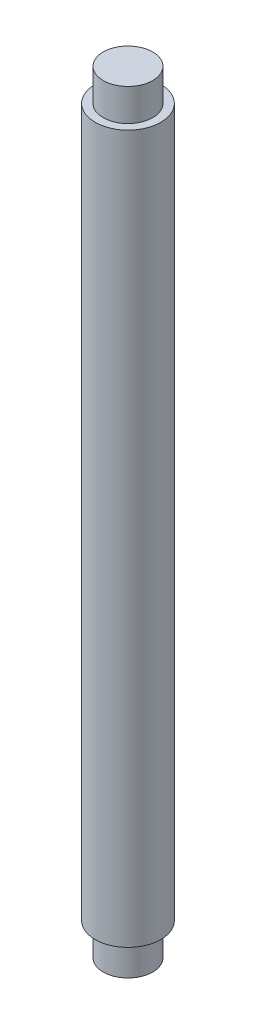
from build123d import *


with BuildPart() as part:
    # Sketch1 → Revolve1 (revolve)
    with BuildSketch(Plane(origin=(0, 0, 0), x_dir=(-1, 0, 0), z_dir=(0, 0, -1)), mode=Mode.PRIVATE) as revolve1_sk:
        Polygon((-2.54, -7.112), (7.239, -7.112), (7.239, 297.688), (-2.54, 297.688), (-2.54, 284.988), (-5.715, 284.988), (-5.715, 5.588), (-2.54, 5.588), align=None)
    revolve(revolve1_sk.sketch.rotate(Axis((-7.239, -7.112, 0), (0, 1, 0)), 270), axis=Axis((-7.239, -7.112, 0), (0, 1, 0)))


solid = part.part
